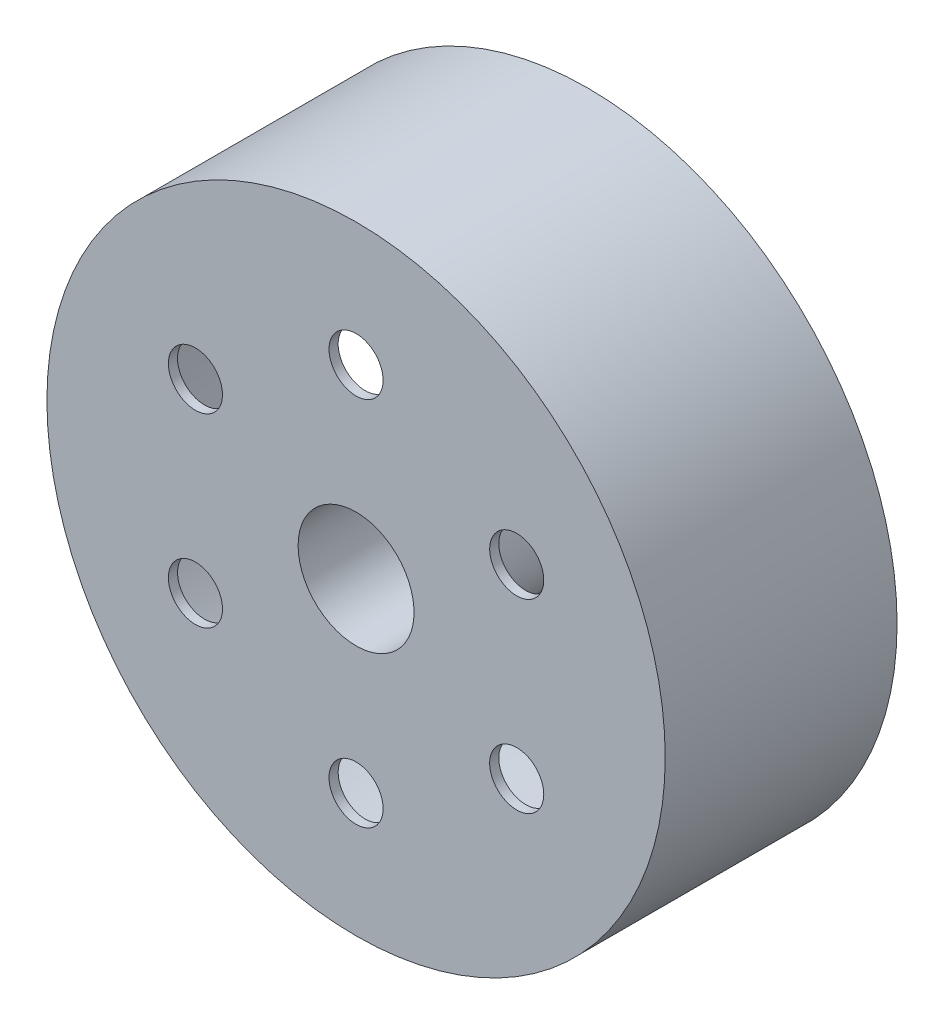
from build123d import *

# Parameters (mm, degrees)
SKETCH1_R           = 101.6
SKETCH1_R_2         = 19.05
BOSS_EXTRUDE1_DEPTH = 76.2
SKETCH3_R           = 96.52
SKETCH3_R_2         = 24.13
CUT_EXTRUDE1_DEPTH  = 73.2
SKETCH4_R           = 8.89
CUT_EXTRUDE2_DEPTH  = 20.828
CIRPATTERN1_COUNT   = 6


with BuildPart() as part:
    # Sketch1 → Boss-Extrude1 (new body)
    with BuildSketch(Plane.XY):
        with Locations(Location((0, 0, 0), (0, 0, 180))):
            Circle(SKETCH1_R)
        with Locations(Location((0, 0, 0), (0, 0, 180))):
            Circle(SKETCH1_R_2, mode=Mode.SUBTRACT)
    extrude(amount=BOSS_EXTRUDE1_DEPTH)

    # Sketch3 → Cut-Extrude1 (cut)
    with BuildSketch(Plane(origin=(0, 0, 0), x_dir=(-1, 0, 0), z_dir=(0, 0, -1))):
        Circle(SKETCH3_R)
        Circle(SKETCH3_R_2, mode=Mode.SUBTRACT)
    extrude(amount=-CUT_EXTRUDE1_DEPTH, mode=Mode.SUBTRACT)

    # Sketch4 → Cut-Extrude2 (cut)
    with BuildSketch(Plane.XY.offset(76.2)):
        with Locations((0, 60.96)):
            Circle(SKETCH4_R)
    cut_extrude2 = extrude(amount=-CUT_EXTRUDE2_DEPTH, mode=Mode.SUBTRACT)

    # CirPattern1: Cut-Extrude2 ×6 about axis
    cirpattern1_axis = Axis((0, 0, 0), (0, 0, 1))
    for i in range(1, CIRPATTERN1_COUNT):
        add(cut_extrude2.rotate(cirpattern1_axis, i * 360 / CIRPATTERN1_COUNT), mode=Mode.SUBTRACT)


solid = part.part
